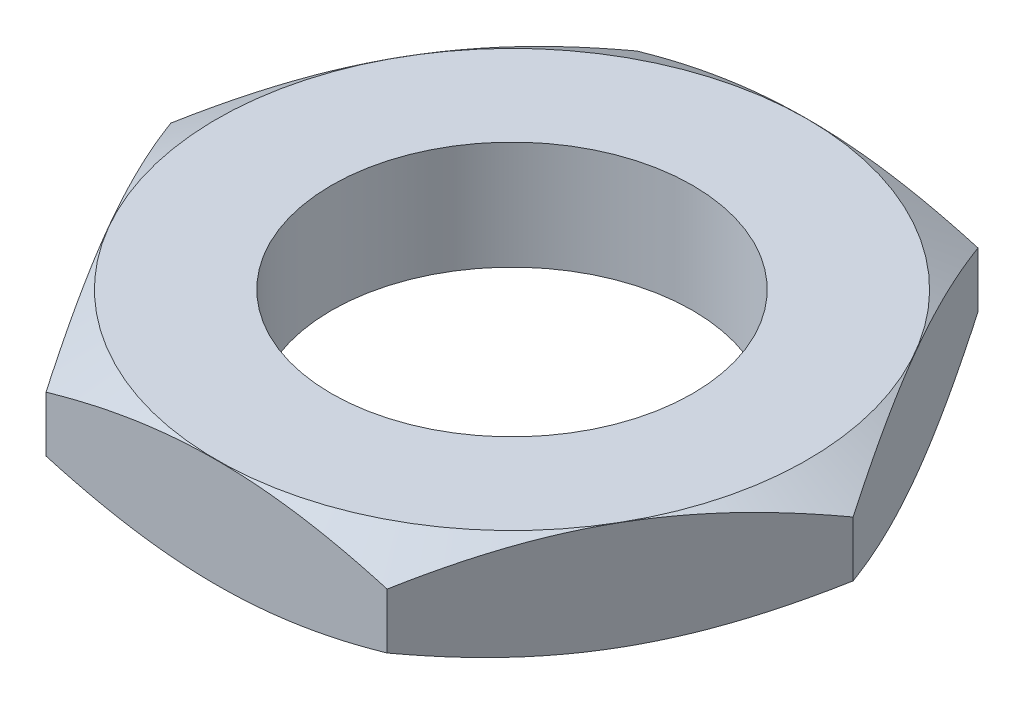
from build123d import *

# Parameters (mm, degrees)
EXTRUDE1_DEPTH     = 3
SKETCH3_R          = 5
CUT_EXTRUDE1_DEPTH = 13.856102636


with BuildPart() as part:
    # Sketch2 → Extrude1 (new body)
    with BuildSketch(Plane(origin=(0, 0, 0), x_dir=(1, 0, 0), z_dir=(0, 1, 0))):
        Polygon((9.45, 0), (4.725, 8.183940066), (-4.725, 8.183940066), (-9.45, 0), (-4.725, -8.183940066), (4.725, -8.183940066), align=None)
    extrude(amount=EXTRUDE1_DEPTH)

    # Sketch3 → Cut-Extrude1 (cut, through all)
    with BuildSketch(Plane(origin=(0, 3, 0), x_dir=(-1, 0, 0), z_dir=(0, 1, 0))):
        with Locations(Location((0, 0, 0), (0, 0, 90))):
            Circle(SKETCH3_R)
    extrude(amount=-CUT_EXTRUDE1_DEPTH, mode=Mode.SUBTRACT)

    # Sketch6 → Cut-Revolve1 (revolve, cut)
    with BuildSketch(Plane.XY, mode=Mode.PRIVATE) as cut_revolve1_sk:
        Polygon((11.117112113, 0), (8.18, 0), (10.002147, 1.052017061), (9.93131586, 1.988877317), (8.18, 3), (11.117112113, 3), align=None)
    revolve(cut_revolve1_sk.sketch.rotate(Axis((0, 0, 0), (0, 1, 0)), 300.000000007), axis=Axis((0, 0, 0), (0, 1, 0)), mode=Mode.SUBTRACT)


solid = part.part
